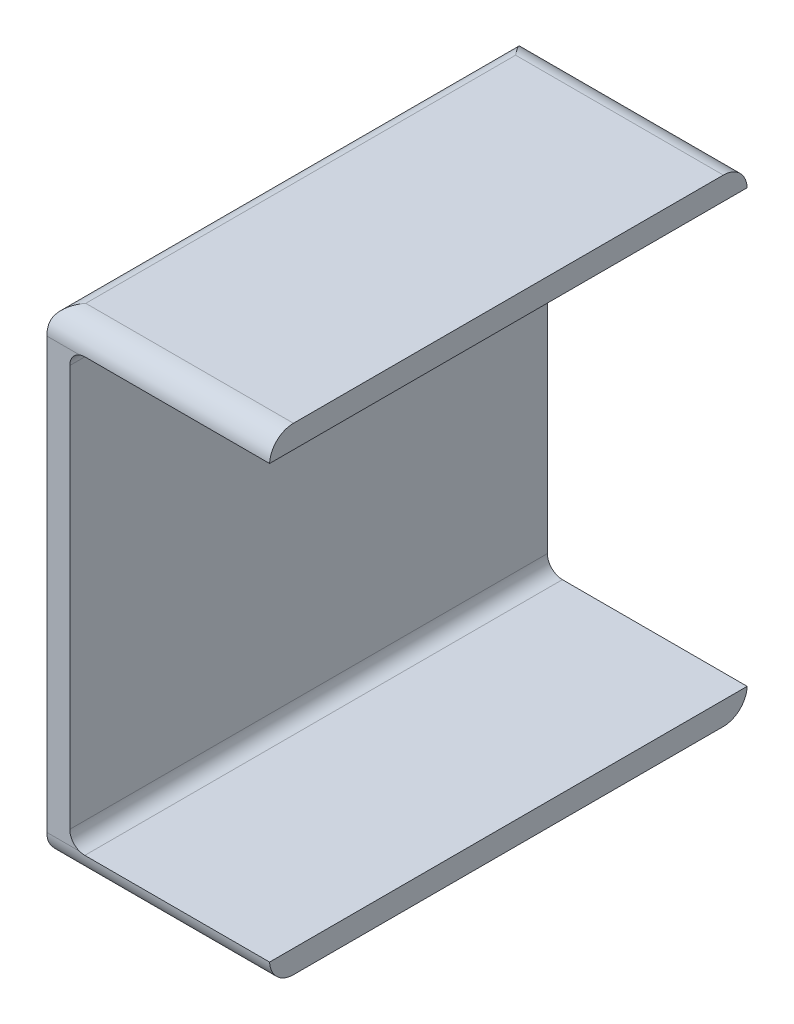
ISO-10303-21;
HEADER;
FILE_DESCRIPTION(('STEP AP214'),'2;1');
FILE_NAME('part.step','',(''),(''),'','','');
FILE_SCHEMA(('AUTOMOTIVE_DESIGN { 1 0 10303 214 1 1 1 1 }'));
ENDSEC;
DATA;
#1=APPLICATION_CONTEXT('core data for automotive mechanical design processes');
#2=APPLICATION_PROTOCOL_DEFINITION('international standard','automotive_design',2000,#1);
#3=PRODUCT_CONTEXT('',#1,'mechanical');
#4=PRODUCT('Part','Part','',(#3));
#5=PRODUCT_RELATED_PRODUCT_CATEGORY('part','',(#4));
#6=PRODUCT_DEFINITION_FORMATION('','',#4);
#7=PRODUCT_DEFINITION_CONTEXT('part definition',#1,'design');
#8=PRODUCT_DEFINITION('design','',#6,#7);
#9=PRODUCT_DEFINITION_SHAPE('','',#8);
#10=(LENGTH_UNIT() NAMED_UNIT(*) SI_UNIT(.MILLI.,.METRE.));
#11=(NAMED_UNIT(*) PLANE_ANGLE_UNIT() SI_UNIT($,.RADIAN.));
#12=(NAMED_UNIT(*) SI_UNIT($,.STERADIAN.) SOLID_ANGLE_UNIT());
#13=UNCERTAINTY_MEASURE_WITH_UNIT(LENGTH_MEASURE(1.E-05),#10,'distance_accuracy_value','');
#14=(GEOMETRIC_REPRESENTATION_CONTEXT(3) GLOBAL_UNCERTAINTY_ASSIGNED_CONTEXT((#13)) GLOBAL_UNIT_ASSIGNED_CONTEXT((#10,
#11,#12)) REPRESENTATION_CONTEXT('',''));
#15=CARTESIAN_POINT('',(0.,0.,0.));
#16=DIRECTION('',(0.,0.,1.));
#17=DIRECTION('',(1.,0.,0.));
#18=AXIS2_PLACEMENT_3D('',#15,#16,#17);
#19=CARTESIAN_POINT('',(0.,63.5,63.5));
#20=DIRECTION('',(0.,-1.,0.));
#21=DIRECTION('',(0.,0.,-1.));
#22=AXIS2_PLACEMENT_3D('',#19,#20,#21);
#23=PLANE('',#22);
#24=DIRECTION('',(1.,0.,0.));
#25=VECTOR('',#24,1.);
#26=CARTESIAN_POINT('',(-29.6125,63.5,60.325));
#27=LINE('',#26,#25);
#28=CARTESIAN_POINT('',(-27.6125,63.5,60.325));
#29=VERTEX_POINT('',#28);
#30=CARTESIAN_POINT('',(0.,63.5,60.325));
#31=VERTEX_POINT('',#30);
#32=EDGE_CURVE('E204',#29,#31,#27,.T.);
#33=ORIENTED_EDGE('',*,*,#32,.T.);
#34=DIRECTION('',(0.,0.,-1.));
#35=VECTOR('',#34,1.);
#36=CARTESIAN_POINT('',(0.,63.5,63.5));
#37=LINE('',#36,#35);
#38=CARTESIAN_POINT('',(6.E-06,63.5,3.175));
#39=VERTEX_POINT('',#38);
#40=EDGE_CURVE('E40',#31,#39,#37,.T.);
#41=ORIENTED_EDGE('',*,*,#40,.T.);
#42=DIRECTION('',(1.,0.,0.));
#43=VECTOR('',#42,1.);
#44=CARTESIAN_POINT('',(-29.6125,63.5,3.175));
#45=LINE('',#44,#43);
#46=CARTESIAN_POINT('',(-27.6125,63.5,3.175));
#47=VERTEX_POINT('',#46);
#48=EDGE_CURVE('E203',#47,#39,#45,.T.);
#49=ORIENTED_EDGE('',*,*,#48,.F.);
#50=DIRECTION('',(0.,0.,-1.));
#51=VECTOR('',#50,1.);
#52=CARTESIAN_POINT('',(-27.6125,63.5,63.5));
#53=LINE('',#52,#51);
#54=EDGE_CURVE('E191',#29,#47,#53,.T.);
#55=ORIENTED_EDGE('',*,*,#54,.F.);
#56=EDGE_LOOP('',(#33,#41,#49,#55));
#57=FACE_BOUND('',#56,.T.);
#58=ADVANCED_FACE('F36',(#57),#23,.F.);
#59=CARTESIAN_POINT('',(-27.6125,0.,63.5));
#60=DIRECTION('',(0.,1.,0.));
#61=DIRECTION('',(0.,0.,1.));
#62=AXIS2_PLACEMENT_3D('',#59,#60,#61);
#63=PLANE('',#62);
#64=DIRECTION('',(0.,0.,-1.));
#65=VECTOR('',#64,1.);
#66=CARTESIAN_POINT('',(0.,0.,63.5));
#67=LINE('',#66,#65);
#68=CARTESIAN_POINT('',(6.E-06,0.,60.325));
#69=VERTEX_POINT('',#68);
#70=CARTESIAN_POINT('',(0.,0.,3.175));
#71=VERTEX_POINT('',#70);
#72=EDGE_CURVE('E168',#69,#71,#67,.T.);
#73=ORIENTED_EDGE('',*,*,#72,.F.);
#74=DIRECTION('',(1.,0.,0.));
#75=VECTOR('',#74,1.);
#76=CARTESIAN_POINT('',(-29.6125,0.,60.325));
#77=LINE('',#76,#75);
#78=CARTESIAN_POINT('',(-27.6125,0.,60.325));
#79=VERTEX_POINT('',#78);
#80=EDGE_CURVE('E328',#79,#69,#77,.T.);
#81=ORIENTED_EDGE('',*,*,#80,.F.);
#82=DIRECTION('',(0.,0.,-1.));
#83=VECTOR('',#82,1.);
#84=CARTESIAN_POINT('',(-27.6125,0.,63.5));
#85=LINE('',#84,#83);
#86=CARTESIAN_POINT('',(-27.6125,0.,3.175));
#87=VERTEX_POINT('',#86);
#88=EDGE_CURVE('E170',#79,#87,#85,.T.);
#89=ORIENTED_EDGE('',*,*,#88,.T.);
#90=DIRECTION('',(1.,0.,0.));
#91=VECTOR('',#90,1.);
#92=CARTESIAN_POINT('',(-29.6125,0.,3.175));
#93=LINE('',#92,#91);
#94=EDGE_CURVE('E153',#87,#71,#93,.T.);
#95=ORIENTED_EDGE('',*,*,#94,.T.);
#96=EDGE_LOOP('',(#73,#81,#89,#95));
#97=FACE_BOUND('',#96,.T.);
#98=ADVANCED_FACE('F166',(#97),#63,.F.);
#99=CARTESIAN_POINT('',(-27.6125,61.5,63.5));
#100=DIRECTION('',(0.,0.,1.));
#101=DIRECTION('',(1.,0.,0.));
#102=AXIS2_PLACEMENT_3D('',#99,#100,#101);
#103=PLANE('',#102);
#104=CARTESIAN_POINT('',(-24.5645,58.452,63.5));
#105=DIRECTION('',(0.,0.,-1.));
#106=DIRECTION('',(1.,0.,0.));
#107=AXIS2_PLACEMENT_3D('',#104,#105,#106);
#108=CIRCLE('',#107,2.);
#109=CARTESIAN_POINT('',(-26.5645,58.452,63.5));
#110=VERTEX_POINT('',#109);
#111=CARTESIAN_POINT('',(-25.2658351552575,60.325,63.5));
#112=VERTEX_POINT('',#111);
#113=EDGE_CURVE('E397',#110,#112,#108,.T.);
#114=ORIENTED_EDGE('',*,*,#113,.T.);
#115=DIRECTION('',(1.,0.,0.));
#116=VECTOR('',#115,1.);
#117=CARTESIAN_POINT('',(-29.6125,60.325,63.5));
#118=LINE('',#117,#116);
#119=CARTESIAN_POINT('',(-29.6125,60.325,63.5));
#120=VERTEX_POINT('',#119);
#121=EDGE_CURVE('E323',#120,#112,#118,.T.);
#122=ORIENTED_EDGE('',*,*,#121,.F.);
#123=DIRECTION('',(0.,-1.,0.));
#124=VECTOR('',#123,1.);
#125=CARTESIAN_POINT('',(-29.6125,61.5,63.5));
#126=LINE('',#125,#124);
#127=CARTESIAN_POINT('',(-29.6125,3.175,63.5));
#128=VERTEX_POINT('',#127);
#129=EDGE_CURVE('E255',#120,#128,#126,.T.);
#130=ORIENTED_EDGE('',*,*,#129,.T.);
#131=DIRECTION('',(1.,0.,0.));
#132=VECTOR('',#131,1.);
#133=CARTESIAN_POINT('',(-29.6125,3.175,63.5));
#134=LINE('',#133,#132);
#135=CARTESIAN_POINT('',(-25.2658351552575,3.175,63.5));
#136=VERTEX_POINT('',#135);
#137=EDGE_CURVE('E322',#128,#136,#134,.T.);
#138=ORIENTED_EDGE('',*,*,#137,.T.);
#139=CARTESIAN_POINT('',(-24.5645,5.04799999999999,63.5));
#140=DIRECTION('',(0.,0.,-1.));
#141=DIRECTION('',(1.,0.,0.));
#142=AXIS2_PLACEMENT_3D('',#139,#140,#141);
#143=CIRCLE('',#142,2.);
#144=CARTESIAN_POINT('',(-26.5645,5.04799999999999,63.5));
#145=VERTEX_POINT('',#144);
#146=EDGE_CURVE('E392',#136,#145,#143,.T.);
#147=ORIENTED_EDGE('',*,*,#146,.T.);
#148=DIRECTION('',(0.,1.,0.));
#149=VECTOR('',#148,1.);
#150=CARTESIAN_POINT('',(-26.5645,5.04799999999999,63.5));
#151=LINE('',#150,#149);
#152=EDGE_CURVE('E396',#145,#110,#151,.T.);
#153=ORIENTED_EDGE('',*,*,#152,.T.);
#154=EDGE_LOOP('',(#114,#122,#130,#138,#147,#153));
#155=FACE_BOUND('',#154,.T.);
#156=ADVANCED_FACE('F368',(#155),#103,.T.);
#157=CARTESIAN_POINT('',(-27.6125,61.5,0.));
#158=DIRECTION('',(0.,0.,1.));
#159=DIRECTION('',(1.,0.,0.));
#160=AXIS2_PLACEMENT_3D('',#157,#158,#159);
#161=PLANE('',#160);
#162=CARTESIAN_POINT('',(-24.5645,5.04799999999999,0.));
#163=DIRECTION('',(0.,0.,-1.));
#164=DIRECTION('',(1.,0.,0.));
#165=AXIS2_PLACEMENT_3D('',#162,#163,#164);
#166=CIRCLE('',#165,2.);
#167=CARTESIAN_POINT('',(-25.2658351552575,3.175,0.));
#168=VERTEX_POINT('',#167);
#169=CARTESIAN_POINT('',(-26.5645,5.04799999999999,0.));
#170=VERTEX_POINT('',#169);
#171=EDGE_CURVE('E406',#168,#170,#166,.T.);
#172=ORIENTED_EDGE('',*,*,#171,.F.);
#173=DIRECTION('',(1.,0.,0.));
#174=VECTOR('',#173,1.);
#175=CARTESIAN_POINT('',(-29.6125,3.175,0.));
#176=LINE('',#175,#174);
#177=CARTESIAN_POINT('',(-29.6125,3.17500000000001,0.));
#178=VERTEX_POINT('',#177);
#179=EDGE_CURVE('E171',#178,#168,#176,.T.);
#180=ORIENTED_EDGE('',*,*,#179,.F.);
#181=DIRECTION('',(0.,-1.,0.));
#182=VECTOR('',#181,1.);
#183=CARTESIAN_POINT('',(-29.6125,61.5,0.));
#184=LINE('',#183,#182);
#185=CARTESIAN_POINT('',(-29.6125,60.325,0.));
#186=VERTEX_POINT('',#185);
#187=EDGE_CURVE('E252',#186,#178,#184,.T.);
#188=ORIENTED_EDGE('',*,*,#187,.F.);
#189=DIRECTION('',(1.,0.,0.));
#190=VECTOR('',#189,1.);
#191=CARTESIAN_POINT('',(-29.6125,60.325,0.));
#192=LINE('',#191,#190);
#193=CARTESIAN_POINT('',(-25.2658351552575,60.325,0.));
#194=VERTEX_POINT('',#193);
#195=EDGE_CURVE('E297',#186,#194,#192,.T.);
#196=ORIENTED_EDGE('',*,*,#195,.T.);
#197=CARTESIAN_POINT('',(-24.5645,58.452,0.));
#198=DIRECTION('',(0.,0.,-1.));
#199=DIRECTION('',(1.,0.,0.));
#200=AXIS2_PLACEMENT_3D('',#197,#198,#199);
#201=CIRCLE('',#200,2.);
#202=CARTESIAN_POINT('',(-26.5645,58.452,0.));
#203=VERTEX_POINT('',#202);
#204=EDGE_CURVE('E400',#203,#194,#201,.T.);
#205=ORIENTED_EDGE('',*,*,#204,.F.);
#206=DIRECTION('',(0.,1.,0.));
#207=VECTOR('',#206,1.);
#208=CARTESIAN_POINT('',(-26.5645,5.04799999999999,0.));
#209=LINE('',#208,#207);
#210=EDGE_CURVE('E408',#170,#203,#209,.T.);
#211=ORIENTED_EDGE('',*,*,#210,.F.);
#212=EDGE_LOOP('',(#172,#180,#188,#196,#205,#211));
#213=FACE_BOUND('',#212,.T.);
#214=ADVANCED_FACE('F286',(#213),#161,.F.);
#215=CARTESIAN_POINT('',(-24.5645,60.452,63.5));
#216=DIRECTION('',(0.,1.,0.));
#217=DIRECTION('',(0.,0.,1.));
#218=AXIS2_PLACEMENT_3D('',#215,#216,#217);
#219=PLANE('',#218);
#220=DIRECTION('',(0.,0.,-1.));
#221=VECTOR('',#220,1.);
#222=CARTESIAN_POINT('',(0.,60.452,63.5));
#223=LINE('',#222,#221);
#224=CARTESIAN_POINT('',(0.,60.452,63.4974589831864));
#225=VERTEX_POINT('',#224);
#226=CARTESIAN_POINT('',(0.,60.452,0.00254101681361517));
#227=VERTEX_POINT('',#226);
#228=EDGE_CURVE('E11',#225,#227,#223,.T.);
#229=ORIENTED_EDGE('',*,*,#228,.F.);
#230=DIRECTION('',(1.,0.,0.));
#231=VECTOR('',#230,1.);
#232=CARTESIAN_POINT('',(-29.6125,60.452,63.4974589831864));
#233=LINE('',#232,#231);
#234=CARTESIAN_POINT('',(-24.5645,60.452,63.4974589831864));
#235=VERTEX_POINT('',#234);
#236=EDGE_CURVE('E275',#225,#235,#233,.F.);
#237=ORIENTED_EDGE('',*,*,#236,.T.);
#238=DIRECTION('',(0.,0.,-1.));
#239=VECTOR('',#238,1.);
#240=CARTESIAN_POINT('',(-24.5645,60.452,63.5));
#241=LINE('',#240,#239);
#242=CARTESIAN_POINT('',(-24.5645,60.452,0.00254101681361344));
#243=VERTEX_POINT('',#242);
#244=EDGE_CURVE('E404',#235,#243,#241,.T.);
#245=ORIENTED_EDGE('',*,*,#244,.T.);
#246=DIRECTION('',(1.,0.,0.));
#247=VECTOR('',#246,1.);
#248=CARTESIAN_POINT('',(-29.6125,60.452,0.00254101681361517));
#249=LINE('',#248,#247);
#250=EDGE_CURVE('E215',#243,#227,#249,.T.);
#251=ORIENTED_EDGE('',*,*,#250,.T.);
#252=EDGE_LOOP('',(#229,#237,#245,#251));
#253=FACE_BOUND('',#252,.T.);
#254=ADVANCED_FACE('F38',(#253),#219,.F.);
#255=CARTESIAN_POINT('',(0.,60.452,63.5));
#256=DIRECTION('',(-1.,0.,0.));
#257=DIRECTION('',(0.,0.,1.));
#258=AXIS2_PLACEMENT_3D('',#255,#256,#257);
#259=PLANE('',#258);
#260=ORIENTED_EDGE('',*,*,#40,.F.);
#261=CARTESIAN_POINT('',(0.,60.325,60.325));
#262=DIRECTION('',(-1.,0.,0.));
#263=DIRECTION('',(0.,0.,1.));
#264=AXIS2_PLACEMENT_3D('',#261,#262,#263);
#265=CIRCLE('',#264,3.17499999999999);
#266=EDGE_CURVE('E209',#31,#225,#265,.F.);
#267=ORIENTED_EDGE('',*,*,#266,.T.);
#268=ORIENTED_EDGE('',*,*,#228,.T.);
#269=CARTESIAN_POINT('',(0.,60.325,3.175));
#270=DIRECTION('',(-1.,0.,0.));
#271=DIRECTION('',(0.,0.,1.));
#272=AXIS2_PLACEMENT_3D('',#269,#270,#271);
#273=CIRCLE('',#272,3.175);
#274=EDGE_CURVE('E211',#227,#39,#273,.F.);
#275=ORIENTED_EDGE('',*,*,#274,.T.);
#276=EDGE_LOOP('',(#260,#267,#268,#275));
#277=FACE_BOUND('',#276,.T.);
#278=ADVANCED_FACE('F208',(#277),#259,.F.);
#279=CARTESIAN_POINT('',(-27.6125,61.5,63.5));
#280=DIRECTION('',(0.,0.,-1.));
#281=DIRECTION('',(-1.,0.,0.));
#282=AXIS2_PLACEMENT_3D('',#279,#280,#281);
#283=CYLINDRICAL_SURFACE('',#282,2.);
#284=DIRECTION('',(0.,0.,-1.));
#285=VECTOR('',#284,1.);
#286=CARTESIAN_POINT('',(-29.6125,61.5,63.5));
#287=LINE('',#286,#285);
#288=CARTESIAN_POINT('',(-29.6125,61.5,63.2745762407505));
#289=VERTEX_POINT('',#288);
#290=CARTESIAN_POINT('',(-29.6125,61.5,0.225423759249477));
#291=VERTEX_POINT('',#290);
#292=EDGE_CURVE('E188',#289,#291,#287,.T.);
#293=ORIENTED_EDGE('',*,*,#292,.F.);
#294=CARTESIAN_POINT('',(-29.6125,61.5,63.2745762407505));
#295=CARTESIAN_POINT('',(-29.612507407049,61.5579303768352,63.2515142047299));
#296=CARTESIAN_POINT('',(-29.6099840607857,61.6151352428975,63.2267341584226));
#297=CARTESIAN_POINT('',(-29.6003064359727,61.7275886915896,63.1740690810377));
#298=CARTESIAN_POINT('',(-29.5931595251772,61.782840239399,63.1461890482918));
#299=CARTESIAN_POINT('',(-29.5747565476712,61.8905193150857,63.0878773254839));
#300=CARTESIAN_POINT('',(-29.5635429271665,61.9429698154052,63.0574744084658));
#301=CARTESIAN_POINT('',(-29.5374251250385,62.0453983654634,62.9941732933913));
#302=CARTESIAN_POINT('',(-29.5225191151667,62.0953751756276,62.9612738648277));
#303=CARTESIAN_POINT('',(-29.4647562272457,62.2651906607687,62.8425568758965));
#304=CARTESIAN_POINT('',(-29.4133415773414,62.3781882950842,62.7509208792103));
#305=CARTESIAN_POINT('',(-29.2956413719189,62.5869741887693,62.5576061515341));
#306=CARTESIAN_POINT('',(-29.2292865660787,62.6826784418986,62.4558819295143));
#307=CARTESIAN_POINT('',(-29.0578698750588,62.891261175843,62.2041292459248));
#308=CARTESIAN_POINT('',(-28.9478455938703,62.9961031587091,62.0508309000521));
#309=CARTESIAN_POINT('',(-28.7153214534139,63.1749126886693,61.7361874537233));
#310=CARTESIAN_POINT('',(-28.5928087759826,63.2488481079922,61.5748341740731));
#311=CARTESIAN_POINT('',(-28.330768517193,63.372608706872,61.2348838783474));
#312=CARTESIAN_POINT('',(-28.1906569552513,63.4201431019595,61.0559148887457));
#313=CARTESIAN_POINT('',(-27.9068091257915,63.4835478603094,60.6958335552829));
#314=CARTESIAN_POINT('',(-27.7630811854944,63.4994852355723,60.5147265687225));
#315=CARTESIAN_POINT('',(-27.6171705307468,63.4999959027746,60.3308846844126));
#316=CARTESIAN_POINT('',(-27.6148352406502,63.4999999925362,60.3279423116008));
#317=CARTESIAN_POINT('',(-27.6125,63.5,60.325));
#318=B_SPLINE_CURVE_WITH_KNOTS('',3,(#294,#295,#296,#297,#298,#299,#300,#301,#302,#303,#304,
#305,#306,#307,#308,#309,#310,#311,#312,#313,#314,#315,#316,#317),.UNSPECIFIED.,.F.,.F.,(4,2,2,
2,2,2,2,2,2,2,2,4),(0.,0.186920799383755,0.373544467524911,0.558273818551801,0.743094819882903,
1.20325633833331,1.66559637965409,2.30967223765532,2.95441596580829,3.64873106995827,
4.34157206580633,4.35284150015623),.UNSPECIFIED.);
#319=EDGE_CURVE('E245',#289,#29,#318,.T.);
#320=ORIENTED_EDGE('',*,*,#319,.T.);
#321=ORIENTED_EDGE('',*,*,#54,.T.);
#322=CARTESIAN_POINT('',(-29.6125,61.5,0.225423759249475));
#323=CARTESIAN_POINT('',(-29.612507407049,61.5579303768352,0.248485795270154));
#324=CARTESIAN_POINT('',(-29.6099840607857,61.6151352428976,0.273265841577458));
#325=CARTESIAN_POINT('',(-29.6003064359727,61.7275886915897,0.32593091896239));
#326=CARTESIAN_POINT('',(-29.5931595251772,61.7828402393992,0.353810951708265));
#327=CARTESIAN_POINT('',(-29.5747565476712,61.8905193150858,0.412122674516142));
#328=CARTESIAN_POINT('',(-29.5635429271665,61.9429698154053,0.442525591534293));
#329=CARTESIAN_POINT('',(-29.5374251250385,62.0453983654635,0.505826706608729));
#330=CARTESIAN_POINT('',(-29.5225191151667,62.0953751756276,0.53872613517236));
#331=CARTESIAN_POINT('',(-29.4647562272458,62.2651906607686,0.657443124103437));
#332=CARTESIAN_POINT('',(-29.4133415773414,62.3781882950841,0.74907912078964));
#333=CARTESIAN_POINT('',(-29.2956413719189,62.5869741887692,0.942393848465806));
#334=CARTESIAN_POINT('',(-29.2292865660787,62.6826784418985,1.04411807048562));
#335=CARTESIAN_POINT('',(-29.0578698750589,62.891261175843,1.29587075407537));
#336=CARTESIAN_POINT('',(-28.9478455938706,62.9961031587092,1.44916909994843));
#337=CARTESIAN_POINT('',(-28.7153214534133,63.1749126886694,1.76381254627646));
#338=CARTESIAN_POINT('',(-28.5928087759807,63.2488481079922,1.92516582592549));
#339=CARTESIAN_POINT('',(-28.330768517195,63.372608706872,2.26511612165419));
#340=CARTESIAN_POINT('',(-28.190656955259,63.4201431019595,2.4440851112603));
#341=CARTESIAN_POINT('',(-27.9068091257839,63.4835478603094,2.80416644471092));
#342=CARTESIAN_POINT('',(-27.7630811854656,63.4994852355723,2.98527343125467));
#343=CARTESIAN_POINT('',(-27.6171705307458,63.4999959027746,3.1691153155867));
#344=CARTESIAN_POINT('',(-27.6148352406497,63.4999999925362,3.1720576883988));
#345=CARTESIAN_POINT('',(-27.6125,63.5,3.175));
#346=B_SPLINE_CURVE_WITH_KNOTS('',3,(#322,#323,#324,#325,#326,#327,#328,#329,#330,#331,#332,
#333,#334,#335,#336,#337,#338,#339,#340,#341,#342,#343,#344,#345),.UNSPECIFIED.,.F.,.F.,(4,2,2,
2,2,2,2,2,2,2,2,4),(0.,0.186920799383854,0.373544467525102,0.558273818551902,0.743094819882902,
1.20325633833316,1.66559637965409,2.30967223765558,2.95441596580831,3.64873106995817,
4.34157206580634,4.35284150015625),.UNSPECIFIED.);
#347=EDGE_CURVE('E214',#47,#291,#346,.F.);
#348=ORIENTED_EDGE('',*,*,#347,.T.);
#349=EDGE_LOOP('',(#293,#320,#321,#348));
#350=FACE_BOUND('',#349,.T.);
#351=ADVANCED_FACE('F236',(#350),#283,.T.);
#352=CARTESIAN_POINT('',(-29.6125,61.5,63.5));
#353=DIRECTION('',(1.,0.,0.));
#354=DIRECTION('',(0.,0.,-1.));
#355=AXIS2_PLACEMENT_3D('',#352,#353,#354);
#356=PLANE('',#355);
#357=ORIENTED_EDGE('',*,*,#129,.F.);
#358=CARTESIAN_POINT('',(-29.6125,60.325,60.325));
#359=DIRECTION('',(-1.,0.,0.));
#360=DIRECTION('',(0.,0.,-1.));
#361=AXIS2_PLACEMENT_3D('',#358,#359,#360);
#362=CIRCLE('',#361,3.17499999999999);
#363=EDGE_CURVE('E61',#120,#289,#362,.T.);
#364=ORIENTED_EDGE('',*,*,#363,.T.);
#365=ORIENTED_EDGE('',*,*,#292,.T.);
#366=CARTESIAN_POINT('',(-29.6125,60.325,3.175));
#367=DIRECTION('',(-1.,0.,0.));
#368=DIRECTION('',(0.,0.,-1.));
#369=AXIS2_PLACEMENT_3D('',#366,#367,#368);
#370=CIRCLE('',#369,3.175);
#371=EDGE_CURVE('E302',#291,#186,#370,.T.);
#372=ORIENTED_EDGE('',*,*,#371,.T.);
#373=ORIENTED_EDGE('',*,*,#187,.T.);
#374=CARTESIAN_POINT('',(-29.6125,3.175,3.175));
#375=DIRECTION('',(-1.,0.,0.));
#376=DIRECTION('',(0.,0.,-1.));
#377=AXIS2_PLACEMENT_3D('',#374,#375,#376);
#378=CIRCLE('',#377,3.175);
#379=CARTESIAN_POINT('',(-29.6125,2.,0.225423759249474));
#380=VERTEX_POINT('',#379);
#381=EDGE_CURVE('E172',#178,#380,#378,.T.);
#382=ORIENTED_EDGE('',*,*,#381,.T.);
#383=DIRECTION('',(0.,0.,-1.));
#384=VECTOR('',#383,1.);
#385=CARTESIAN_POINT('',(-29.6125,2.,63.5));
#386=LINE('',#385,#384);
#387=CARTESIAN_POINT('',(-29.6125,2.,63.2745762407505));
#388=VERTEX_POINT('',#387);
#389=EDGE_CURVE('E178',#388,#380,#386,.T.);
#390=ORIENTED_EDGE('',*,*,#389,.F.);
#391=CARTESIAN_POINT('',(-29.6125,3.175,60.325));
#392=DIRECTION('',(-1.,0.,0.));
#393=DIRECTION('',(0.,0.,-1.));
#394=AXIS2_PLACEMENT_3D('',#391,#392,#393);
#395=CIRCLE('',#394,3.175);
#396=EDGE_CURVE('E319',#388,#128,#395,.T.);
#397=ORIENTED_EDGE('',*,*,#396,.T.);
#398=EDGE_LOOP('',(#357,#364,#365,#372,#373,#382,#390,#397));
#399=FACE_BOUND('',#398,.T.);
#400=ADVANCED_FACE('F241',(#399),#356,.F.);
#401=CARTESIAN_POINT('',(-27.6125,2.,63.5));
#402=DIRECTION('',(0.,0.,-1.));
#403=DIRECTION('',(-1.,0.,0.));
#404=AXIS2_PLACEMENT_3D('',#401,#402,#403);
#405=CYLINDRICAL_SURFACE('',#404,2.);
#406=ORIENTED_EDGE('',*,*,#88,.F.);
#407=CARTESIAN_POINT('',(-29.6125,2.,63.2745762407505));
#408=CARTESIAN_POINT('',(-29.612507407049,1.9420696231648,63.2515142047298));
#409=CARTESIAN_POINT('',(-29.6099840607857,1.8848647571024,63.2267341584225));
#410=CARTESIAN_POINT('',(-29.6003064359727,1.77241130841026,63.1740690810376));
#411=CARTESIAN_POINT('',(-29.5931595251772,1.71715976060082,63.1461890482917));
#412=CARTESIAN_POINT('',(-29.5747565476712,1.60948068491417,63.0878773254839));
#413=CARTESIAN_POINT('',(-29.5635429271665,1.55703018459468,63.0574744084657));
#414=CARTESIAN_POINT('',(-29.5374251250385,1.4546016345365,62.9941732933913));
#415=CARTESIAN_POINT('',(-29.5225191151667,1.40462482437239,62.9612738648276));
#416=CARTESIAN_POINT('',(-29.4647562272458,1.23480933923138,62.8425568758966));
#417=CARTESIAN_POINT('',(-29.4133415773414,1.12181170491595,62.7509208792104));
#418=CARTESIAN_POINT('',(-29.295641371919,0.913025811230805,62.5576061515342));
#419=CARTESIAN_POINT('',(-29.2292865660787,0.817321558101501,62.4558819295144));
#420=CARTESIAN_POINT('',(-29.0578698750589,0.608738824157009,62.2041292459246));
#421=CARTESIAN_POINT('',(-28.9478455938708,0.50389684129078,62.0508309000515));
#422=CARTESIAN_POINT('',(-28.7153214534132,0.325087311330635,61.7361874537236));
#423=CARTESIAN_POINT('',(-28.5928087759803,0.251151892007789,61.5748341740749));
#424=CARTESIAN_POINT('',(-28.3307685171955,0.127391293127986,61.2348838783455));
#425=CARTESIAN_POINT('',(-28.1906569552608,0.0798568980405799,61.0559148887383));
#426=CARTESIAN_POINT('',(-27.9068091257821,0.0164521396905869,60.6958335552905));
#427=CARTESIAN_POINT('',(-27.763081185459,0.000514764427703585,60.5147265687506));
#428=CARTESIAN_POINT('',(-27.6171705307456,4.09722537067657E-06,60.3308846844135));
#429=CARTESIAN_POINT('',(-27.6148352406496,7.4637558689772E-09,60.3279423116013));
#430=CARTESIAN_POINT('',(-27.6125,0.,60.325));
#431=B_SPLINE_CURVE_WITH_KNOTS('',3,(#407,#408,#409,#410,#411,#412,#413,#414,#415,#416,#417,
#418,#419,#420,#421,#422,#423,#424,#425,#426,#427,#428,#429,#430),.UNSPECIFIED.,.F.,.F.,(4,2,2,
2,2,2,2,2,2,2,2,4),(0.,0.186920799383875,0.373544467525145,0.558273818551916,0.743094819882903,
1.20325633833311,1.66559637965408,2.30967223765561,2.95441596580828,3.64873106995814,
4.34157206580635,4.35284150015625),.UNSPECIFIED.);
#432=EDGE_CURVE('E276',#79,#388,#431,.F.);
#433=ORIENTED_EDGE('',*,*,#432,.T.);
#434=ORIENTED_EDGE('',*,*,#389,.T.);
#435=CARTESIAN_POINT('',(-29.6125,2.,0.225423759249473));
#436=CARTESIAN_POINT('',(-29.612507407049,1.9420696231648,0.248485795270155));
#437=CARTESIAN_POINT('',(-29.6099840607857,1.8848647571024,0.273265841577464));
#438=CARTESIAN_POINT('',(-29.6003064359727,1.77241130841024,0.325930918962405));
#439=CARTESIAN_POINT('',(-29.5931595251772,1.7171597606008,0.353810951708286));
#440=CARTESIAN_POINT('',(-29.5747565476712,1.60948068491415,0.412122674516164));
#441=CARTESIAN_POINT('',(-29.5635429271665,1.55703018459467,0.44252559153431));
#442=CARTESIAN_POINT('',(-29.5374251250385,1.45460163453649,0.505826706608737));
#443=CARTESIAN_POINT('',(-29.5225191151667,1.40462482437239,0.538726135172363));
#444=CARTESIAN_POINT('',(-29.4647562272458,1.23480933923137,0.657443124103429));
#445=CARTESIAN_POINT('',(-29.4133415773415,1.12181170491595,0.749079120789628));
#446=CARTESIAN_POINT('',(-29.295641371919,0.913025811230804,0.942393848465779));
#447=CARTESIAN_POINT('',(-29.2292865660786,0.817321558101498,1.04411807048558));
#448=CARTESIAN_POINT('',(-29.0578698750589,0.608738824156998,1.29587075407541));
#449=CARTESIAN_POINT('',(-28.9478455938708,0.503896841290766,1.44916909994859));
#450=CARTESIAN_POINT('',(-28.7153214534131,0.325087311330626,1.76381254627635));
#451=CARTESIAN_POINT('',(-28.5928087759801,0.251151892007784,1.92516582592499));
#452=CARTESIAN_POINT('',(-28.3307685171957,0.127391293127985,2.2651161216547));
#453=CARTESIAN_POINT('',(-28.1906569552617,0.0798568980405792,2.44408511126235));
#454=CARTESIAN_POINT('',(-27.9068091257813,0.0164521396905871,2.80416644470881));
#455=CARTESIAN_POINT('',(-27.7630811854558,0.000514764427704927,2.98527343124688));
#456=CARTESIAN_POINT('',(-27.6171705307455,4.09722537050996E-06,3.16911531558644));
#457=CARTESIAN_POINT('',(-27.6148352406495,7.46375567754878E-09,3.17205768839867));
#458=CARTESIAN_POINT('',(-27.6125,0.,3.175));
#459=B_SPLINE_CURVE_WITH_KNOTS('',3,(#435,#436,#437,#438,#439,#440,#441,#442,#443,#444,#445,
#446,#447,#448,#449,#450,#451,#452,#453,#454,#455,#456,#457,#458),.UNSPECIFIED.,.F.,.F.,(4,2,2,
2,2,2,2,2,2,2,2,4),(0.,0.186920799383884,0.373544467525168,0.55827381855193,0.743094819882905,
1.20325633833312,1.66559637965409,2.30967223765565,2.95441596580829,3.64873106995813,
4.34157206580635,4.35284150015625),.UNSPECIFIED.);
#460=EDGE_CURVE('E161',#380,#87,#459,.T.);
#461=ORIENTED_EDGE('',*,*,#460,.T.);
#462=EDGE_LOOP('',(#406,#433,#434,#461));
#463=FACE_BOUND('',#462,.T.);
#464=ADVANCED_FACE('F374',(#463),#405,.T.);
#465=CARTESIAN_POINT('',(0.,0.,63.5));
#466=DIRECTION('',(-1.,0.,0.));
#467=DIRECTION('',(0.,0.,1.));
#468=AXIS2_PLACEMENT_3D('',#465,#466,#467);
#469=PLANE('',#468);
#470=DIRECTION('',(0.,0.,-1.));
#471=VECTOR('',#470,1.);
#472=CARTESIAN_POINT('',(0.,3.04799999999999,63.5));
#473=LINE('',#472,#471);
#474=CARTESIAN_POINT('',(0.,3.04799999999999,63.4974589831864));
#475=VERTEX_POINT('',#474);
#476=CARTESIAN_POINT('',(0.,3.04799999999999,0.00254101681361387));
#477=VERTEX_POINT('',#476);
#478=EDGE_CURVE('E177',#475,#477,#473,.T.);
#479=ORIENTED_EDGE('',*,*,#478,.F.);
#480=CARTESIAN_POINT('',(0.,3.175,60.325));
#481=DIRECTION('',(-1.,0.,0.));
#482=DIRECTION('',(0.,0.,1.));
#483=AXIS2_PLACEMENT_3D('',#480,#481,#482);
#484=CIRCLE('',#483,3.175);
#485=EDGE_CURVE('E176',#475,#69,#484,.F.);
#486=ORIENTED_EDGE('',*,*,#485,.T.);
#487=ORIENTED_EDGE('',*,*,#72,.T.);
#488=CARTESIAN_POINT('',(0.,3.175,3.175));
#489=DIRECTION('',(-1.,0.,0.));
#490=DIRECTION('',(0.,0.,1.));
#491=AXIS2_PLACEMENT_3D('',#488,#489,#490);
#492=CIRCLE('',#491,3.175);
#493=EDGE_CURVE('E150',#71,#477,#492,.F.);
#494=ORIENTED_EDGE('',*,*,#493,.T.);
#495=EDGE_LOOP('',(#479,#486,#487,#494));
#496=FACE_BOUND('',#495,.T.);
#497=ADVANCED_FACE('F175',(#496),#469,.F.);
#498=CARTESIAN_POINT('',(0.,3.04799999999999,63.5));
#499=DIRECTION('',(0.,-1.,0.));
#500=DIRECTION('',(0.,0.,-1.));
#501=AXIS2_PLACEMENT_3D('',#498,#499,#500);
#502=PLANE('',#501);
#503=DIRECTION('',(0.,0.,-1.));
#504=VECTOR('',#503,1.);
#505=CARTESIAN_POINT('',(-24.5645,3.04799999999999,63.5));
#506=LINE('',#505,#504);
#507=CARTESIAN_POINT('',(-24.5645,3.04799999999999,63.4974589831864));
#508=VERTEX_POINT('',#507);
#509=CARTESIAN_POINT('',(-24.5645,3.04799999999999,0.00254101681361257));
#510=VERTEX_POINT('',#509);
#511=EDGE_CURVE('E180',#508,#510,#506,.T.);
#512=ORIENTED_EDGE('',*,*,#511,.F.);
#513=DIRECTION('',(1.,0.,0.));
#514=VECTOR('',#513,1.);
#515=CARTESIAN_POINT('',(-29.6125,3.04799999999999,63.4974589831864));
#516=LINE('',#515,#514);
#517=EDGE_CURVE('E341',#508,#475,#516,.T.);
#518=ORIENTED_EDGE('',*,*,#517,.T.);
#519=ORIENTED_EDGE('',*,*,#478,.T.);
#520=DIRECTION('',(1.,0.,0.));
#521=VECTOR('',#520,1.);
#522=CARTESIAN_POINT('',(-29.6125,3.04799999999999,0.00254101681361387));
#523=LINE('',#522,#521);
#524=EDGE_CURVE('E156',#477,#510,#523,.F.);
#525=ORIENTED_EDGE('',*,*,#524,.T.);
#526=EDGE_LOOP('',(#512,#518,#519,#525));
#527=FACE_BOUND('',#526,.T.);
#528=ADVANCED_FACE('F347',(#527),#502,.F.);
#529=CARTESIAN_POINT('',(-24.5645,5.04799999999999,63.5));
#530=DIRECTION('',(0.,0.,-1.));
#531=DIRECTION('',(-1.,0.,0.));
#532=AXIS2_PLACEMENT_3D('',#529,#530,#531);
#533=CYLINDRICAL_SURFACE('',#532,2.);
#534=ORIENTED_EDGE('',*,*,#146,.F.);
#535=CARTESIAN_POINT('',(-25.2658351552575,3.175,63.5));
#536=CARTESIAN_POINT('',(-25.2096905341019,3.15396934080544,63.4999887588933));
#537=CARTESIAN_POINT('',(-25.1525975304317,3.135477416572,63.4997910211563));
#538=CARTESIAN_POINT('',(-25.0374437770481,3.10381522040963,63.4992438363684));
#539=CARTESIAN_POINT('',(-24.9793943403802,3.09060378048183,63.4988956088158));
#540=CARTESIAN_POINT('',(-24.8623483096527,3.06940867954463,63.4982616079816));
#541=CARTESIAN_POINT('',(-24.8033517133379,3.06142503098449,63.4979758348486));
#542=CARTESIAN_POINT('',(-24.6844065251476,3.05069584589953,63.4975669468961));
#543=CARTESIAN_POINT('',(-24.6244540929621,3.04799282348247,63.4974451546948));
#544=CARTESIAN_POINT('',(-24.5645,3.04799999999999,63.4974589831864));
#545=B_SPLINE_CURVE_WITH_KNOTS('',3,(#535,#536,#537,#538,#539,#540,#541,#542,#543,#544),
.UNSPECIFIED.,.F.,.F.,(4,2,2,2,4),(0.,0.179798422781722,0.358166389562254,0.536534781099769,
0.716333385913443),.UNSPECIFIED.);
#546=EDGE_CURVE('E53',#136,#508,#545,.T.);
#547=ORIENTED_EDGE('',*,*,#546,.T.);
#548=ORIENTED_EDGE('',*,*,#511,.T.);
#549=CARTESIAN_POINT('',(-24.5645,3.04799999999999,0.00254101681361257));
#550=CARTESIAN_POINT('',(-24.6244540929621,3.04799282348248,0.00255484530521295));
#551=CARTESIAN_POINT('',(-24.6844065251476,3.05069584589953,0.00243305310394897));
#552=CARTESIAN_POINT('',(-24.8033517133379,3.06142503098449,0.00202416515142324));
#553=CARTESIAN_POINT('',(-24.8623483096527,3.06940867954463,0.00173839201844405));
#554=CARTESIAN_POINT('',(-24.9793943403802,3.09060378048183,0.0011043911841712));
#555=CARTESIAN_POINT('',(-25.0374437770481,3.10381522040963,0.000756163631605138));
#556=CARTESIAN_POINT('',(-25.1525975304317,3.135477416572,0.000208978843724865));
#557=CARTESIAN_POINT('',(-25.2096905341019,3.15396934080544,1.12411066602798E-05));
#558=CARTESIAN_POINT('',(-25.2658351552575,3.175,0.));
#559=B_SPLINE_CURVE_WITH_KNOTS('',3,(#549,#550,#551,#552,#553,#554,#555,#556,#557,#558),
.UNSPECIFIED.,.F.,.F.,(4,2,2,2,4),(0.,0.179798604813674,0.358166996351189,0.536534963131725,
0.716333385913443),.UNSPECIFIED.);
#560=EDGE_CURVE('E217',#510,#168,#559,.T.);
#561=ORIENTED_EDGE('',*,*,#560,.T.);
#562=ORIENTED_EDGE('',*,*,#171,.T.);
#563=DIRECTION('',(0.,0.,-1.));
#564=VECTOR('',#563,1.);
#565=CARTESIAN_POINT('',(-26.5645,5.04799999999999,63.5));
#566=LINE('',#565,#564);
#567=EDGE_CURVE('E394',#145,#170,#566,.T.);
#568=ORIENTED_EDGE('',*,*,#567,.F.);
#569=EDGE_LOOP('',(#534,#547,#548,#561,#562,#568));
#570=FACE_BOUND('',#569,.T.);
#571=ADVANCED_FACE('F343',(#570),#533,.F.);
#572=CARTESIAN_POINT('',(-26.5645,5.04799999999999,63.5));
#573=DIRECTION('',(-1.,0.,0.));
#574=DIRECTION('',(0.,0.,1.));
#575=AXIS2_PLACEMENT_3D('',#572,#573,#574);
#576=PLANE('',#575);
#577=ORIENTED_EDGE('',*,*,#210,.T.);
#578=DIRECTION('',(0.,0.,-1.));
#579=VECTOR('',#578,1.);
#580=CARTESIAN_POINT('',(-26.5645,58.452,63.5));
#581=LINE('',#580,#579);
#582=EDGE_CURVE('E413',#110,#203,#581,.T.);
#583=ORIENTED_EDGE('',*,*,#582,.F.);
#584=ORIENTED_EDGE('',*,*,#152,.F.);
#585=ORIENTED_EDGE('',*,*,#567,.T.);
#586=EDGE_LOOP('',(#577,#583,#584,#585));
#587=FACE_BOUND('',#586,.T.);
#588=ADVANCED_FACE('F284',(#587),#576,.F.);
#589=CARTESIAN_POINT('',(-24.5645,58.452,63.5));
#590=DIRECTION('',(0.,0.,-1.));
#591=DIRECTION('',(-1.,0.,0.));
#592=AXIS2_PLACEMENT_3D('',#589,#590,#591);
#593=CYLINDRICAL_SURFACE('',#592,2.);
#594=ORIENTED_EDGE('',*,*,#244,.F.);
#595=CARTESIAN_POINT('',(-24.5645,60.452,63.4974589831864));
#596=CARTESIAN_POINT('',(-24.6244540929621,60.4520071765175,63.4974451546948));
#597=CARTESIAN_POINT('',(-24.6844065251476,60.4493041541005,63.497566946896));
#598=CARTESIAN_POINT('',(-24.8033517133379,60.4385749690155,63.4979758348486));
#599=CARTESIAN_POINT('',(-24.8623483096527,60.4305913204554,63.4982616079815));
#600=CARTESIAN_POINT('',(-24.9793943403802,60.4093962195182,63.4988956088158));
#601=CARTESIAN_POINT('',(-25.0374437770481,60.3961847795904,63.4992438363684));
#602=CARTESIAN_POINT('',(-25.1525975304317,60.364522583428,63.4997910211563));
#603=CARTESIAN_POINT('',(-25.2096905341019,60.3460306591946,63.4999887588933));
#604=CARTESIAN_POINT('',(-25.2658351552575,60.325,63.5));
#605=B_SPLINE_CURVE_WITH_KNOTS('',3,(#595,#596,#597,#598,#599,#600,#601,#602,#603,#604),
.UNSPECIFIED.,.F.,.F.,(4,2,2,2,4),(0.,0.17979860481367,0.358166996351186,0.536534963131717,
0.716333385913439),.UNSPECIFIED.);
#606=EDGE_CURVE('E266',#235,#112,#605,.T.);
#607=ORIENTED_EDGE('',*,*,#606,.T.);
#608=ORIENTED_EDGE('',*,*,#113,.F.);
#609=ORIENTED_EDGE('',*,*,#582,.T.);
#610=ORIENTED_EDGE('',*,*,#204,.T.);
#611=CARTESIAN_POINT('',(-25.2658351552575,60.325,0.));
#612=CARTESIAN_POINT('',(-25.2096905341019,60.3460306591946,1.12411066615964E-05));
#613=CARTESIAN_POINT('',(-25.1525975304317,60.364522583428,0.000208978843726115));
#614=CARTESIAN_POINT('',(-25.0374437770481,60.3961847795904,0.000756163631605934));
#615=CARTESIAN_POINT('',(-24.9793943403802,60.4093962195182,0.0011043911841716));
#616=CARTESIAN_POINT('',(-24.8623483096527,60.4305913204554,0.00173839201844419));
#617=CARTESIAN_POINT('',(-24.8033517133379,60.4385749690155,0.0020241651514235));
#618=CARTESIAN_POINT('',(-24.6844065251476,60.4493041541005,0.00243305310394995));
#619=CARTESIAN_POINT('',(-24.6244540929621,60.4520071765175,0.00255484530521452));
#620=CARTESIAN_POINT('',(-24.5645,60.452,0.00254101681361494));
#621=B_SPLINE_CURVE_WITH_KNOTS('',3,(#611,#612,#613,#614,#615,#616,#617,#618,#619,#620),
.UNSPECIFIED.,.F.,.F.,(4,2,2,2,4),(0.,0.179798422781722,0.358166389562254,0.536534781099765,
0.716333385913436),.UNSPECIFIED.);
#622=EDGE_CURVE('E219',#194,#243,#621,.T.);
#623=ORIENTED_EDGE('',*,*,#622,.T.);
#624=EDGE_LOOP('',(#594,#607,#608,#609,#610,#623));
#625=FACE_BOUND('',#624,.T.);
#626=ADVANCED_FACE('F279',(#625),#593,.F.);
#627=CARTESIAN_POINT('',(-29.6125,60.325,3.175));
#628=DIRECTION('',(1.,0.,0.));
#629=DIRECTION('',(0.,0.,-1.));
#630=AXIS2_PLACEMENT_3D('',#627,#628,#629);
#631=CYLINDRICAL_SURFACE('',#630,3.175);
#632=ORIENTED_EDGE('',*,*,#48,.T.);
#633=ORIENTED_EDGE('',*,*,#274,.F.);
#634=ORIENTED_EDGE('',*,*,#250,.F.);
#635=ORIENTED_EDGE('',*,*,#622,.F.);
#636=ORIENTED_EDGE('',*,*,#195,.F.);
#637=ORIENTED_EDGE('',*,*,#371,.F.);
#638=ORIENTED_EDGE('',*,*,#347,.F.);
#639=EDGE_LOOP('',(#632,#633,#634,#635,#636,#637,#638));
#640=FACE_BOUND('',#639,.T.);
#641=ADVANCED_FACE('F232',(#640),#631,.T.);
#642=CARTESIAN_POINT('',(-29.6125,3.175,3.175));
#643=DIRECTION('',(1.,0.,0.));
#644=DIRECTION('',(0.,0.,-1.));
#645=AXIS2_PLACEMENT_3D('',#642,#643,#644);
#646=CYLINDRICAL_SURFACE('',#645,3.175);
#647=ORIENTED_EDGE('',*,*,#381,.F.);
#648=ORIENTED_EDGE('',*,*,#179,.T.);
#649=ORIENTED_EDGE('',*,*,#560,.F.);
#650=ORIENTED_EDGE('',*,*,#524,.F.);
#651=ORIENTED_EDGE('',*,*,#493,.F.);
#652=ORIENTED_EDGE('',*,*,#94,.F.);
#653=ORIENTED_EDGE('',*,*,#460,.F.);
#654=EDGE_LOOP('',(#647,#648,#649,#650,#651,#652,#653));
#655=FACE_BOUND('',#654,.T.);
#656=ADVANCED_FACE('F152',(#655),#646,.T.);
#657=CARTESIAN_POINT('',(-29.6125,3.175,60.325));
#658=DIRECTION('',(1.,0.,0.));
#659=DIRECTION('',(0.,0.,-1.));
#660=AXIS2_PLACEMENT_3D('',#657,#658,#659);
#661=CYLINDRICAL_SURFACE('',#660,3.175);
#662=ORIENTED_EDGE('',*,*,#80,.T.);
#663=ORIENTED_EDGE('',*,*,#485,.F.);
#664=ORIENTED_EDGE('',*,*,#517,.F.);
#665=ORIENTED_EDGE('',*,*,#546,.F.);
#666=ORIENTED_EDGE('',*,*,#137,.F.);
#667=ORIENTED_EDGE('',*,*,#396,.F.);
#668=ORIENTED_EDGE('',*,*,#432,.F.);
#669=EDGE_LOOP('',(#662,#663,#664,#665,#666,#667,#668));
#670=FACE_BOUND('',#669,.T.);
#671=ADVANCED_FACE('F261',(#670),#661,.T.);
#672=CARTESIAN_POINT('',(-29.6125,60.325,60.325));
#673=DIRECTION('',(1.,0.,0.));
#674=DIRECTION('',(0.,0.,-1.));
#675=AXIS2_PLACEMENT_3D('',#672,#673,#674);
#676=CYLINDRICAL_SURFACE('',#675,3.17499999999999);
#677=ORIENTED_EDGE('',*,*,#363,.F.);
#678=ORIENTED_EDGE('',*,*,#121,.T.);
#679=ORIENTED_EDGE('',*,*,#606,.F.);
#680=ORIENTED_EDGE('',*,*,#236,.F.);
#681=ORIENTED_EDGE('',*,*,#266,.F.);
#682=ORIENTED_EDGE('',*,*,#32,.F.);
#683=ORIENTED_EDGE('',*,*,#319,.F.);
#684=EDGE_LOOP('',(#677,#678,#679,#680,#681,#682,#683));
#685=FACE_BOUND('',#684,.T.);
#686=ADVANCED_FACE('F257',(#685),#676,.T.);
#687=CLOSED_SHELL('',(#58,#98,#156,#214,#254,#278,#351,#400,#464,#497,#528,#571,#588,#626,#641,
#656,#671,#686));
#688=MANIFOLD_SOLID_BREP('B2',#687);
#689=ADVANCED_BREP_SHAPE_REPRESENTATION('',(#18,#688),#14);
#690=SHAPE_DEFINITION_REPRESENTATION(#9,#689);
ENDSEC;
END-ISO-10303-21;
